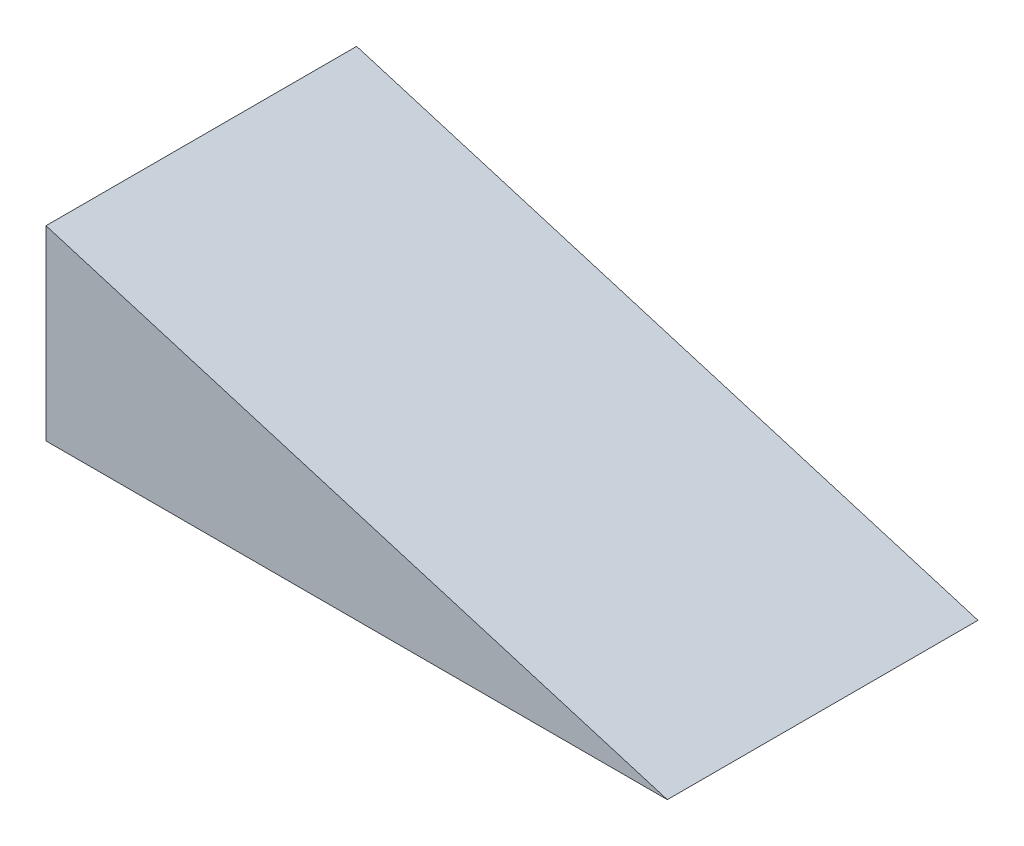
from build123d import *

# Parameters (mm, degrees)
EXTRUDE1_DEPTH     = 10
SKETCH2_R          = 1.5
CUT_EXTRUDE1_DEPTH = 4


with BuildPart() as part:
    # Sketch1 → Extrude1 (new body)
    with BuildSketch(Plane.XY):
        Polygon((0, 6), (0, 0), (20, 0), align=None)
    extrude(amount=EXTRUDE1_DEPTH)

    # Sketch2 → Cut-Extrude1 (cut)
    with BuildSketch(Plane.ZY):
        with Locations(Location((5, 3, 0), (0, 0, 270))):
            Circle(SKETCH2_R)
    extrude(amount=-CUT_EXTRUDE1_DEPTH, mode=Mode.SUBTRACT)


solid = part.part
